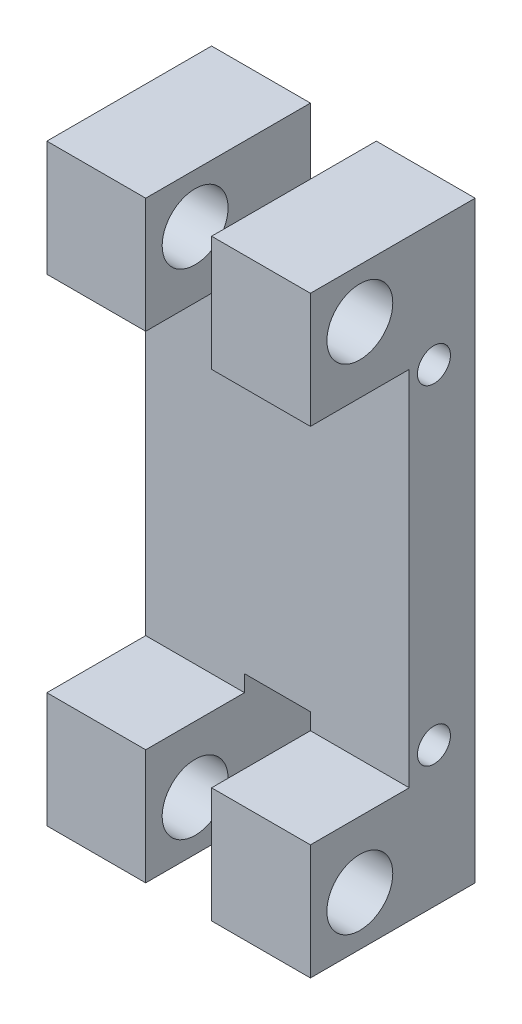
from build123d import *

# Parameters (mm, degrees)
SKETCH1_W           = 50.8
SKETCH1_H           = 114.3
BOSS_EXTRUDE1_DEPTH = 15.875
SKETCH2_R           = 6.35
SKETCH2_W           = 38.1
SKETCH2_H           = 69.85
CUT_EXTRUDE1_DEPTH  = 79.094674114
SKETCH3_W           = 12.7
SKETCH3_H           = 38.1
CUT_EXTRUDE2_DEPTH  = 71.138042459
SKETCH9_R           = 3.175
CUT_EXTRUDE5_DEPTH  = 12.7
SKETCH10_R          = 3.175
CUT_EXTRUDE6_DEPTH  = 12.7


with BuildPart() as part:
    # Sketch1 → Boss-Extrude1 (new, symmetric)
    with BuildSketch(Plane.XY):
        Rectangle(SKETCH1_W, SKETCH1_H)
    extrude(amount=BOSS_EXTRUDE1_DEPTH, both=True)

    # Sketch2 → Cut-Extrude1 (cut, through all)
    with BuildSketch(Plane(origin=(25.4, 0, 0), x_dir=(0, 0, -1), z_dir=(1, 0, 0))):
        with Locations((-6.35, 47.625)):
            Circle(SKETCH2_R)
        with Locations((-6.35, -47.625)):
            Circle(SKETCH2_R)
        with Locations((-15.875, 0)):
            Rectangle(SKETCH2_W, SKETCH2_H)
    extrude(amount=-CUT_EXTRUDE1_DEPTH, mode=Mode.SUBTRACT)

    # Sketch3 → Cut-Extrude2 (cut, through all)
    with BuildSketch(Plane(origin=(0, 0, -15.875), x_dir=(-1, 0, 0), z_dir=(0, 0, -1))):
        with Locations((0, 50.8)):
            Rectangle(SKETCH3_W, SKETCH3_H)
        with Locations((0, -50.8)):
            Rectangle(SKETCH3_W, SKETCH3_H)
    extrude(amount=-CUT_EXTRUDE2_DEPTH, mode=Mode.SUBTRACT)

    # Sketch9 → Cut-Extrude5 (cut)
    with BuildSketch(Plane(origin=(25.4, 0, 0), x_dir=(0, 0, -1), z_dir=(1, 0, 0))):
        with Locations((7.937509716, 33.3375)):
            Circle(SKETCH9_R)
        with Locations((7.937509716, -30.1625)):
            Circle(SKETCH9_R)
    extrude(amount=-CUT_EXTRUDE5_DEPTH, mode=Mode.SUBTRACT)

    # Sketch10 → Cut-Extrude6 (cut)
    with BuildSketch(Plane.ZY.offset(25.4)):
        with Locations((-7.9375, 36.5125)):
            Circle(SKETCH10_R)
        with Locations((-7.9375, -26.9875)):
            Circle(SKETCH10_R)
    extrude(amount=-CUT_EXTRUDE6_DEPTH, mode=Mode.SUBTRACT)


solid = part.part
